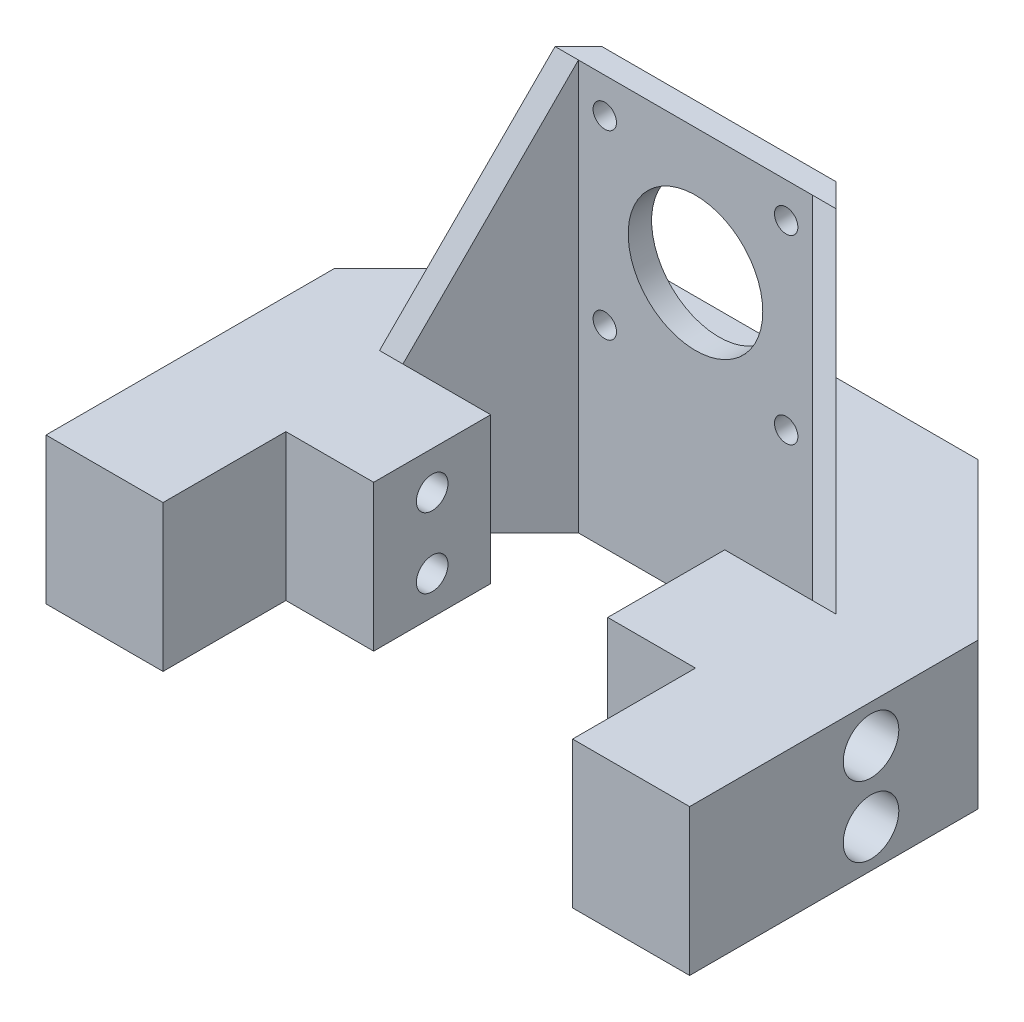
from build123d import *

# Parameters (mm, degrees)
EXTRUDE_1_DEPTH          = 25
SKETCH_2_W               = 15
SKETCH_2_H               = 20
EXTRUDE_2_DEPTH          = 25
EXTRUDE_3_DEPTH          = 45
CUT_EXTRUDE_1_DEPTH      = 40
CUT_EXTRUDE_1_DEPTH_BACK = 40
SKETCH_5_R               = 11.5
SKETCH_5_R_2             = 2
CUT_EXTRUDE_2_DEPTH      = 40
SKETCH_6_R               = 1.45
CUT_EXTRUDE_3_DEPTH      = 10
CUT_EXTRUDE_4_DEPTH      = 111.113577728
CUT_EXTRUDE_4_DEPTH_BACK = 111.113577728
SKETCH_7_R               = 2.7
SKETCH_8_R               = 4.75
CUT_EXTRUDE_5_DEPTH      = 9
CUT_EXTRUDE_START        = -9
SKETCH_9_R               = 4.75
CUT_EXTRUDE_6_DEPTH      = 9
SKETCH_10_W              = 20
SKETCH_10_H              = 25
EXTRUDE_4_DEPTH          = 16


with BuildPart() as part:
    # Sketch 1 → Extrude 1 (new body)
    with BuildSketch(Plane(origin=(0, 0, 0), x_dir=(1, 0, 0), z_dir=(0, 1, 0))):
        Polygon((-28.284271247, 20), (28.284271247, 20), (55, -6.715728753), (55, -40), (35, -40), (35, -15), (20, 0), (-20, 0), (-35, -15), (-35, -40), (-55, -40), (-55, -6.715728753), align=None)
    extrude(amount=EXTRUDE_1_DEPTH)

    # Sketch 2 → Extrude 2 (add)
    with BuildSketch(Plane(origin=(0, 25, 0), x_dir=(1, 0, 0), z_dir=(0, 1, 0))):
        with Locations((27.5, -25)):
            Rectangle(SKETCH_2_W, SKETCH_2_H)
        with Locations((-27.5, -25)):
            Rectangle(SKETCH_2_W, SKETCH_2_H)
    extrude(amount=-EXTRUDE_2_DEPTH)

    # Sketch 3 → Extrude 3 (add)
    with BuildSketch(Plane(origin=(0, 25, 0), x_dir=(1, 0, 0), z_dir=(0, 1, 0))):
        Polygon((-35, -15), (-39, -15), (-20, 4), (20, 4), (39, -15), (35, -15), (20, 0), (-20, 0), align=None)
    extrude(amount=EXTRUDE_3_DEPTH)

    # Sketch 4 → Cut-Extrude 1 (cut, two sides: drawn at the far end of the back side and taken through both)
    with BuildSketch(Plane(origin=(0, 0, 0), x_dir=(0, 0, -1), z_dir=(1, 0, 0)).offset(-CUT_EXTRUDE_1_DEPTH_BACK)):
        Polygon((0, 70), (-15, 25), (-15, 70), align=None)
    extrude(amount=CUT_EXTRUDE_1_DEPTH + CUT_EXTRUDE_1_DEPTH_BACK, mode=Mode.SUBTRACT)

    # Sketch 5 → Cut-Extrude 2 (cut)
    with BuildSketch(Plane.XY):
        with Locations((0, 48.5)):
            Circle(SKETCH_5_R)
        with Locations((-15.5, 64)):
            Circle(SKETCH_5_R_2)
        with Locations((15.5, 64)):
            Circle(SKETCH_5_R_2)
        with Locations((15.5, 33)):
            Circle(SKETCH_5_R_2)
        with Locations((-15.5, 33)):
            Circle(SKETCH_5_R_2)
    extrude(amount=-CUT_EXTRUDE_2_DEPTH, mode=Mode.SUBTRACT)

    # Sketch 6 → Cut-Extrude 3 (cut)
    with BuildSketch(Plane.XZ):
        with Locations(Location((-13.75, -14.5, 0), (0, 0, 270))):
            Circle(SKETCH_6_R)
        with Locations(Location((13.75, -14.5, 0), (0, 0, 270))):
            Circle(SKETCH_6_R)
    extrude(amount=-CUT_EXTRUDE_3_DEPTH, mode=Mode.SUBTRACT)

    # Sketch 7 → Cut-Extrude 4 (cut, two sides: drawn at the far end of the back side and taken through both)
    with BuildSketch(Plane(origin=(-20, 0, 0), x_dir=(0, 0, -1), z_dir=(1, 0, 0)).offset(-CUT_EXTRUDE_4_DEPTH_BACK)):
        with Locations((-25, 18.5)):
            Circle(SKETCH_7_R)
        with Locations(Location((-25, 6.5, 0), (0, 0, 180))):
            Circle(SKETCH_7_R)
    extrude(amount=CUT_EXTRUDE_4_DEPTH + CUT_EXTRUDE_4_DEPTH_BACK, mode=Mode.SUBTRACT)

    # Sketch 8 → Cut-Extrude 5 (cut)
    with BuildSketch(Plane.ZY.offset(55)):
        with Locations((25, 6.5)):
            Circle(SKETCH_8_R)
        with Locations((25, 18.5)):
            Circle(SKETCH_8_R)
    extrude(amount=-CUT_EXTRUDE_5_DEPTH, mode=Mode.SUBTRACT)

    # Sketch 9 → Cut-Extrude 6 (cut)
    with BuildSketch(Plane(origin=(55, 0, 0), x_dir=(0, 0, -1), z_dir=(1, 0, 0)).offset(CUT_EXTRUDE_START)):
        with Locations(Location((-25, 18.5, 0), (0, 0, 180))):
            Circle(SKETCH_9_R)
        with Locations(Location((-25, 6.5, 0), (0, 0, 180))):
            Circle(SKETCH_9_R)
    extrude(amount=CUT_EXTRUDE_6_DEPTH, mode=Mode.SUBTRACT)

    # Sketch 10 → Extrude 4 (add)
    with BuildSketch(Plane.XY.offset(40)):
        with Locations((-45, 12.5)):
            Rectangle(SKETCH_10_W, SKETCH_10_H)
        with Locations((45, 12.5)):
            Rectangle(SKETCH_10_W, SKETCH_10_H)
    extrude(amount=EXTRUDE_4_DEPTH)


solid = part.part
